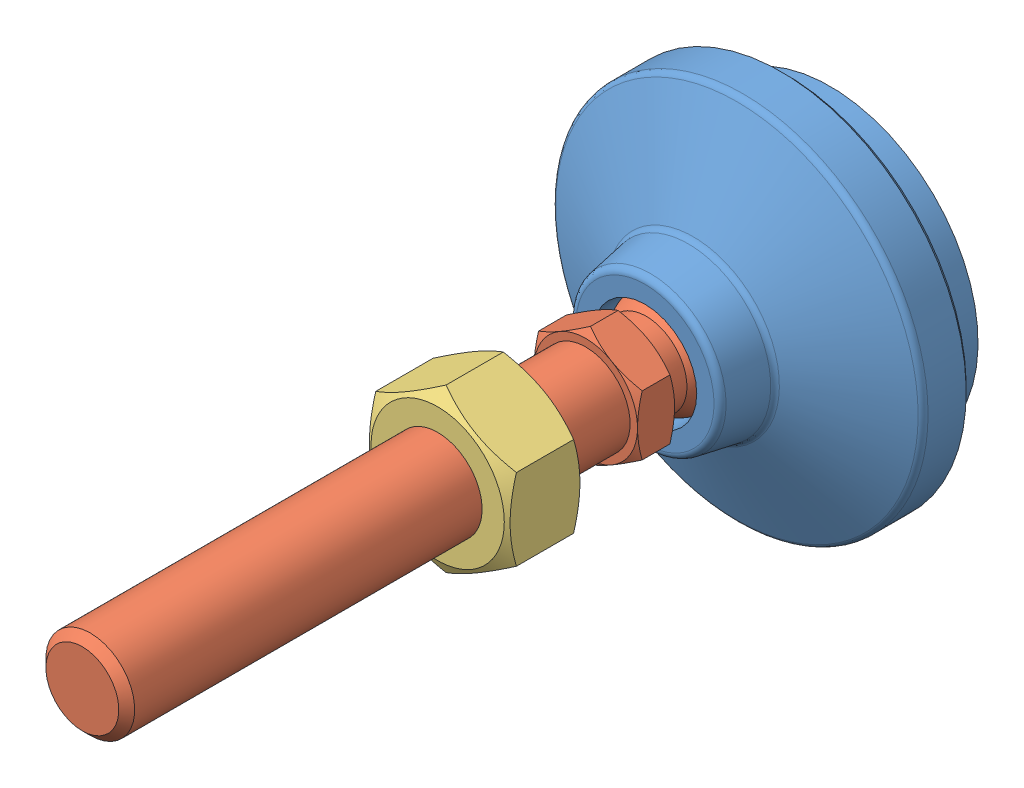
SolidWorks assembly LSVA50-M12X68.sldasm, configuration Default (file format 15000). Lengths in mm.
Overall size (50 50 101).
3 component instances, 3 part files, 0 mates.
Components (placement in the parent):
- LSVA50-M12X68_01-1: LSVA50-M12X68_01.SLDPRT [ﾃﾞﾌｫﾙﾄ] at (0 0 6) x (1 0 0) z (0 -1 0) size (50 25 50)
- LSVA50-M12X68_02-1: LSVA50-M12X68_02.SLDPRT [ﾃﾞﾌｫﾙﾄ] at (0 0 13.5) x (1 0 0) z (0 -1 0) size (14 87.5 16.17)
- LSVA50-M12X68_03-1: LSVA50-M12X68_03.SLDPRT [ﾃﾞﾌｫﾙﾄ] at (0 0 43) size (19 21.94 10)
